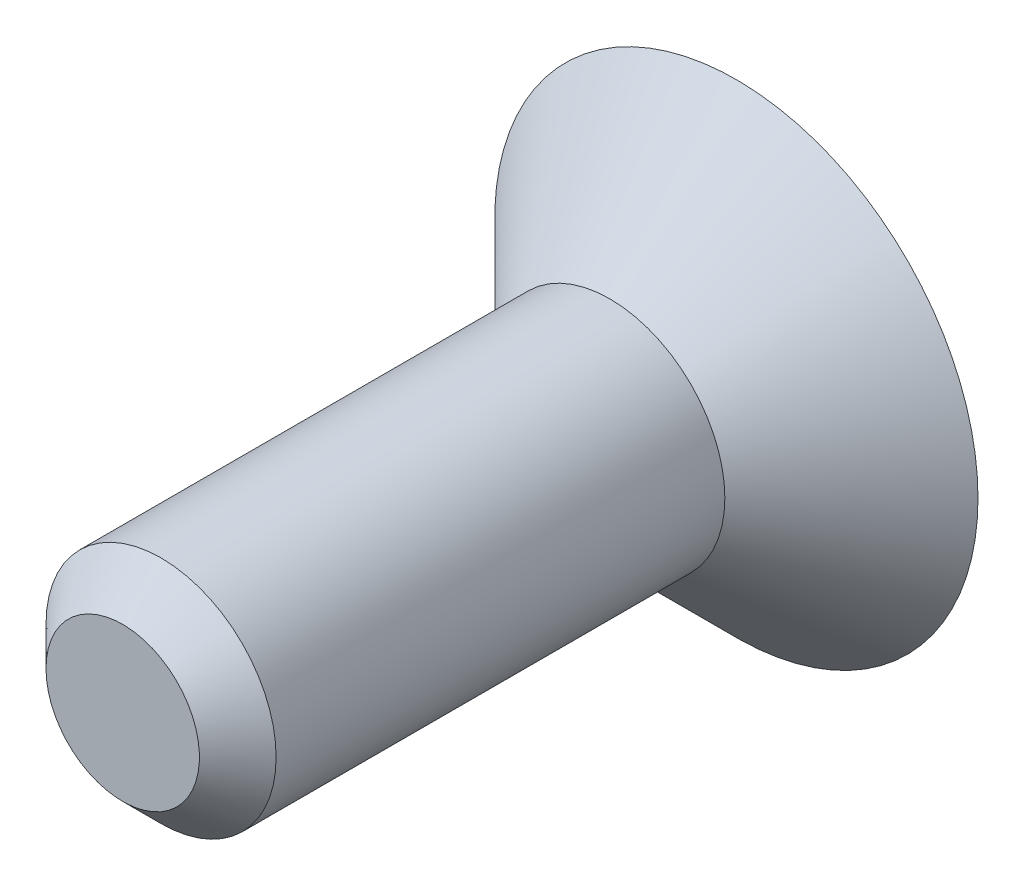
ISO-10303-21;
HEADER;
FILE_DESCRIPTION(('STEP AP214'),'2;1');
FILE_NAME('part.step','',(''),(''),'','','');
FILE_SCHEMA(('AUTOMOTIVE_DESIGN { 1 0 10303 214 1 1 1 1 }'));
ENDSEC;
DATA;
#1=APPLICATION_CONTEXT('core data for automotive mechanical design processes');
#2=APPLICATION_PROTOCOL_DEFINITION('international standard','automotive_design',2000,#1);
#3=PRODUCT_CONTEXT('',#1,'mechanical');
#4=PRODUCT('Part','Part','',(#3));
#5=PRODUCT_RELATED_PRODUCT_CATEGORY('part','',(#4));
#6=PRODUCT_DEFINITION_FORMATION('','',#4);
#7=PRODUCT_DEFINITION_CONTEXT('part definition',#1,'design');
#8=PRODUCT_DEFINITION('design','',#6,#7);
#9=PRODUCT_DEFINITION_SHAPE('','',#8);
#10=(LENGTH_UNIT() NAMED_UNIT(*) SI_UNIT(.MILLI.,.METRE.));
#11=(NAMED_UNIT(*) PLANE_ANGLE_UNIT() SI_UNIT($,.RADIAN.));
#12=(NAMED_UNIT(*) SI_UNIT($,.STERADIAN.) SOLID_ANGLE_UNIT());
#13=UNCERTAINTY_MEASURE_WITH_UNIT(LENGTH_MEASURE(1.E-05),#10,'distance_accuracy_value','');
#14=(GEOMETRIC_REPRESENTATION_CONTEXT(3) GLOBAL_UNCERTAINTY_ASSIGNED_CONTEXT((#13)) GLOBAL_UNIT_ASSIGNED_CONTEXT((#10,
#11,#12)) REPRESENTATION_CONTEXT('',''));
#15=CARTESIAN_POINT('',(0.,0.,0.));
#16=DIRECTION('',(0.,0.,1.));
#17=DIRECTION('',(1.,0.,0.));
#18=AXIS2_PLACEMENT_3D('',#15,#16,#17);
#19=CARTESIAN_POINT('',(0.,0.,0.));
#20=DIRECTION('',(0.,0.,1.));
#21=DIRECTION('',(1.,0.,0.));
#22=AXIS2_PLACEMENT_3D('',#19,#20,#21);
#23=PLANE('',#22);
#24=CARTESIAN_POINT('',(0.,0.,0.));
#25=DIRECTION('',(0.,0.,1.));
#26=DIRECTION('',(1.,0.,0.));
#27=AXIS2_PLACEMENT_3D('',#24,#25,#26);
#28=CIRCLE('',#27,3.15);
#29=CARTESIAN_POINT('',(3.15,0.,0.));
#30=VERTEX_POINT('',#29);
#31=EDGE_CURVE('E214',#30,#30,#28,.T.);
#32=ORIENTED_EDGE('',*,*,#31,.F.);
#33=EDGE_LOOP('',(#32));
#34=FACE_BOUND('',#33,.T.);
#35=DIRECTION('',(0.,-1.,0.));
#36=VECTOR('',#35,1.);
#37=CARTESIAN_POINT('',(-0.399999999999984,1.57500000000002,0.));
#38=LINE('',#37,#36);
#39=CARTESIAN_POINT('',(-0.399999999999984,1.57500000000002,0.));
#40=VERTEX_POINT('',#39);
#41=CARTESIAN_POINT('',(-0.39999999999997,0.400000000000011,0.));
#42=VERTEX_POINT('',#41);
#43=EDGE_CURVE('E120',#40,#42,#38,.T.);
#44=ORIENTED_EDGE('',*,*,#43,.T.);
#45=DIRECTION('',(-1.,0.,0.));
#46=VECTOR('',#45,1.);
#47=CARTESIAN_POINT('',(-1.57499999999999,0.400000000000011,0.));
#48=LINE('',#47,#46);
#49=CARTESIAN_POINT('',(-1.57499999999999,0.400000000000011,0.));
#50=VERTEX_POINT('',#49);
#51=EDGE_CURVE('E184',#42,#50,#48,.T.);
#52=ORIENTED_EDGE('',*,*,#51,.T.);
#53=DIRECTION('',(0.,-1.,0.));
#54=VECTOR('',#53,1.);
#55=CARTESIAN_POINT('',(-1.57499999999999,0.400000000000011,0.));
#56=LINE('',#55,#54);
#57=CARTESIAN_POINT('',(-1.57500000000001,-0.400000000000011,0.));
#58=VERTEX_POINT('',#57);
#59=EDGE_CURVE('E174',#50,#58,#56,.T.);
#60=ORIENTED_EDGE('',*,*,#59,.T.);
#61=DIRECTION('',(1.,0.,0.));
#62=VECTOR('',#61,1.);
#63=CARTESIAN_POINT('',(-1.57500000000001,-0.400000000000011,0.));
#64=LINE('',#63,#62);
#65=CARTESIAN_POINT('',(-0.399999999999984,-0.400000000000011,0.));
#66=VERTEX_POINT('',#65);
#67=EDGE_CURVE('E178',#58,#66,#64,.T.);
#68=ORIENTED_EDGE('',*,*,#67,.T.);
#69=CARTESIAN_POINT('',(-0.399999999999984,-1.57499999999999,0.));
#70=VERTEX_POINT('',#69);
#71=EDGE_CURVE('E130',#66,#70,#38,.T.);
#72=ORIENTED_EDGE('',*,*,#71,.T.);
#73=DIRECTION('',(1.,0.,0.));
#74=VECTOR('',#73,1.);
#75=CARTESIAN_POINT('',(0.399999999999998,-1.57499999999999,0.));
#76=LINE('',#75,#74);
#77=CARTESIAN_POINT('',(0.399999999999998,-1.57499999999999,0.));
#78=VERTEX_POINT('',#77);
#79=EDGE_CURVE('E129',#70,#78,#76,.T.);
#80=ORIENTED_EDGE('',*,*,#79,.T.);
#81=DIRECTION('',(0.,1.,0.));
#82=VECTOR('',#81,1.);
#83=CARTESIAN_POINT('',(0.400000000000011,1.57500000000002,0.));
#84=LINE('',#83,#82);
#85=CARTESIAN_POINT('',(0.399999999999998,-0.400000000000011,0.));
#86=VERTEX_POINT('',#85);
#87=EDGE_CURVE('E150',#78,#86,#84,.T.);
#88=ORIENTED_EDGE('',*,*,#87,.T.);
#89=CARTESIAN_POINT('',(1.57500000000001,-0.400000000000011,0.));
#90=VERTEX_POINT('',#89);
#91=EDGE_CURVE('E177',#86,#90,#64,.T.);
#92=ORIENTED_EDGE('',*,*,#91,.T.);
#93=DIRECTION('',(0.,1.,0.));
#94=VECTOR('',#93,1.);
#95=CARTESIAN_POINT('',(1.57500000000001,0.400000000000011,0.));
#96=LINE('',#95,#94);
#97=CARTESIAN_POINT('',(1.57500000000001,0.400000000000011,0.));
#98=VERTEX_POINT('',#97);
#99=EDGE_CURVE('E181',#90,#98,#96,.T.);
#100=ORIENTED_EDGE('',*,*,#99,.T.);
#101=CARTESIAN_POINT('',(0.400000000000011,0.400000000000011,0.));
#102=VERTEX_POINT('',#101);
#103=EDGE_CURVE('E185',#98,#102,#48,.T.);
#104=ORIENTED_EDGE('',*,*,#103,.T.);
#105=CARTESIAN_POINT('',(0.400000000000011,1.57500000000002,0.));
#106=VERTEX_POINT('',#105);
#107=EDGE_CURVE('E144',#102,#106,#84,.T.);
#108=ORIENTED_EDGE('',*,*,#107,.T.);
#109=DIRECTION('',(-1.,0.,0.));
#110=VECTOR('',#109,1.);
#111=CARTESIAN_POINT('',(0.400000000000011,1.57500000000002,0.));
#112=LINE('',#111,#110);
#113=EDGE_CURVE('E137',#106,#40,#112,.T.);
#114=ORIENTED_EDGE('',*,*,#113,.T.);
#115=EDGE_LOOP('',(#44,#52,#60,#68,#72,#80,#88,#92,#100,#104,#108,#114));
#116=FACE_BOUND('',#115,.T.);
#117=ADVANCED_FACE('F31',(#34,#116),#23,.F.);
#118=CARTESIAN_POINT('',(-1.57500000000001,-0.400000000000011,0.8));
#119=DIRECTION('',(0.,1.,0.));
#120=DIRECTION('',(0.,0.,1.));
#121=AXIS2_PLACEMENT_3D('',#118,#119,#120);
#122=PLANE('',#121);
#123=DIRECTION('',(1.,0.,0.));
#124=VECTOR('',#123,1.);
#125=CARTESIAN_POINT('',(-1.57500000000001,-0.400000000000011,0.8));
#126=LINE('',#125,#124);
#127=CARTESIAN_POINT('',(-1.57500000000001,-0.400000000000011,0.8));
#128=VERTEX_POINT('',#127);
#129=CARTESIAN_POINT('',(-0.399999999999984,-0.400000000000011,0.8));
#130=VERTEX_POINT('',#129);
#131=EDGE_CURVE('E191',#128,#130,#126,.T.);
#132=ORIENTED_EDGE('',*,*,#131,.T.);
#133=DIRECTION('',(0.,0.,-1.));
#134=VECTOR('',#133,1.);
#135=CARTESIAN_POINT('',(-0.399999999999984,-0.400000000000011,0.8));
#136=LINE('',#135,#134);
#137=EDGE_CURVE('E171',#130,#66,#136,.T.);
#138=ORIENTED_EDGE('',*,*,#137,.T.);
#139=ORIENTED_EDGE('',*,*,#67,.F.);
#140=DIRECTION('',(0.,0.,-1.));
#141=VECTOR('',#140,1.);
#142=CARTESIAN_POINT('',(-1.57500000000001,-0.400000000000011,0.8));
#143=LINE('',#142,#141);
#144=EDGE_CURVE('E208',#128,#58,#143,.T.);
#145=ORIENTED_EDGE('',*,*,#144,.F.);
#146=EDGE_LOOP('',(#132,#138,#139,#145));
#147=FACE_BOUND('',#146,.T.);
#148=ADVANCED_FACE('F236',(#147),#122,.T.);
#149=ORIENTED_EDGE('',*,*,#91,.F.);
#150=DIRECTION('',(0.,0.,1.));
#151=VECTOR('',#150,1.);
#152=CARTESIAN_POINT('',(0.399999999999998,-0.400000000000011,0.8));
#153=LINE('',#152,#151);
#154=CARTESIAN_POINT('',(0.399999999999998,-0.400000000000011,0.8));
#155=VERTEX_POINT('',#154);
#156=EDGE_CURVE('E167',#86,#155,#153,.T.);
#157=ORIENTED_EDGE('',*,*,#156,.T.);
#158=CARTESIAN_POINT('',(1.57500000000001,-0.400000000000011,0.8));
#159=VERTEX_POINT('',#158);
#160=EDGE_CURVE('E190',#155,#159,#126,.T.);
#161=ORIENTED_EDGE('',*,*,#160,.T.);
#162=DIRECTION('',(0.,0.,-1.));
#163=VECTOR('',#162,1.);
#164=CARTESIAN_POINT('',(1.57500000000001,-0.400000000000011,0.8));
#165=LINE('',#164,#163);
#166=EDGE_CURVE('E205',#159,#90,#165,.T.);
#167=ORIENTED_EDGE('',*,*,#166,.T.);
#168=EDGE_LOOP('',(#149,#157,#161,#167));
#169=FACE_BOUND('',#168,.T.);
#170=ADVANCED_FACE('F241',(#169),#122,.T.);
#171=CARTESIAN_POINT('',(-1.57499999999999,0.400000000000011,0.8));
#172=DIRECTION('',(0.,-1.,0.));
#173=DIRECTION('',(0.,0.,-1.));
#174=AXIS2_PLACEMENT_3D('',#171,#172,#173);
#175=PLANE('',#174);
#176=ORIENTED_EDGE('',*,*,#51,.F.);
#177=DIRECTION('',(0.,0.,1.));
#178=VECTOR('',#177,1.);
#179=CARTESIAN_POINT('',(-0.39999999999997,0.400000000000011,0.8));
#180=LINE('',#179,#178);
#181=CARTESIAN_POINT('',(-0.39999999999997,0.400000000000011,0.8));
#182=VERTEX_POINT('',#181);
#183=EDGE_CURVE('E125',#42,#182,#180,.T.);
#184=ORIENTED_EDGE('',*,*,#183,.T.);
#185=DIRECTION('',(-1.,0.,0.));
#186=VECTOR('',#185,1.);
#187=CARTESIAN_POINT('',(-1.57499999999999,0.400000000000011,0.8));
#188=LINE('',#187,#186);
#189=CARTESIAN_POINT('',(-1.57499999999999,0.400000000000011,0.8));
#190=VERTEX_POINT('',#189);
#191=EDGE_CURVE('E196',#182,#190,#188,.T.);
#192=ORIENTED_EDGE('',*,*,#191,.T.);
#193=DIRECTION('',(0.,0.,-1.));
#194=VECTOR('',#193,1.);
#195=CARTESIAN_POINT('',(-1.57499999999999,0.400000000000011,0.8));
#196=LINE('',#195,#194);
#197=EDGE_CURVE('E200',#190,#50,#196,.T.);
#198=ORIENTED_EDGE('',*,*,#197,.T.);
#199=EDGE_LOOP('',(#176,#184,#192,#198));
#200=FACE_BOUND('',#199,.T.);
#201=ADVANCED_FACE('F261',(#200),#175,.T.);
#202=CARTESIAN_POINT('',(1.57500000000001,0.400000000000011,0.8));
#203=VERTEX_POINT('',#202);
#204=CARTESIAN_POINT('',(0.400000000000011,0.400000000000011,0.8));
#205=VERTEX_POINT('',#204);
#206=EDGE_CURVE('E197',#203,#205,#188,.T.);
#207=ORIENTED_EDGE('',*,*,#206,.T.);
#208=DIRECTION('',(0.,0.,-1.));
#209=VECTOR('',#208,1.);
#210=CARTESIAN_POINT('',(0.400000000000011,0.400000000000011,0.8));
#211=LINE('',#210,#209);
#212=EDGE_CURVE('E140',#205,#102,#211,.T.);
#213=ORIENTED_EDGE('',*,*,#212,.T.);
#214=ORIENTED_EDGE('',*,*,#103,.F.);
#215=DIRECTION('',(0.,0.,-1.));
#216=VECTOR('',#215,1.);
#217=CARTESIAN_POINT('',(1.57500000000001,0.400000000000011,0.8));
#218=LINE('',#217,#216);
#219=EDGE_CURVE('E203',#203,#98,#218,.T.);
#220=ORIENTED_EDGE('',*,*,#219,.F.);
#221=EDGE_LOOP('',(#207,#213,#214,#220));
#222=FACE_BOUND('',#221,.T.);
#223=ADVANCED_FACE('F264',(#222),#175,.T.);
#224=CARTESIAN_POINT('',(0.,0.,0.));
#225=DIRECTION('',(0.,0.,-1.));
#226=DIRECTION('',(1.,0.,0.));
#227=AXIS2_PLACEMENT_3D('',#224,#225,#226);
#228=CONICAL_SURFACE('',#227,3.15,0.78539816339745);
#229=CARTESIAN_POINT('',(0.,0.,1.64999999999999));
#230=DIRECTION('',(0.,0.,-1.));
#231=DIRECTION('',(-1.,0.,0.));
#232=AXIS2_PLACEMENT_3D('',#229,#230,#231);
#233=CIRCLE('',#232,1.5);
#234=CARTESIAN_POINT('',(-1.5,0.,1.64999999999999));
#235=VERTEX_POINT('',#234);
#236=EDGE_CURVE('E211',#235,#235,#233,.T.);
#237=ORIENTED_EDGE('',*,*,#236,.T.);
#238=EDGE_LOOP('',(#237));
#239=FACE_BOUND('',#238,.T.);
#240=ORIENTED_EDGE('',*,*,#31,.T.);
#241=EDGE_LOOP('',(#240));
#242=FACE_BOUND('',#241,.T.);
#243=ADVANCED_FACE('F33',(#239,#242),#228,.T.);
#244=CARTESIAN_POINT('',(0.,0.,7.99999999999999));
#245=DIRECTION('',(0.,0.,-1.));
#246=DIRECTION('',(-1.,0.,0.));
#247=AXIS2_PLACEMENT_3D('',#244,#245,#246);
#248=CYLINDRICAL_SURFACE('',#247,1.5);
#249=CARTESIAN_POINT('',(0.,0.,7.49999999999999));
#250=DIRECTION('',(0.,0.,-1.));
#251=DIRECTION('',(-1.,0.,0.));
#252=AXIS2_PLACEMENT_3D('',#249,#250,#251);
#253=CIRCLE('',#252,1.5);
#254=CARTESIAN_POINT('',(-1.5,0.,7.49999999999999));
#255=VERTEX_POINT('',#254);
#256=EDGE_CURVE('E39',#255,#255,#253,.T.);
#257=ORIENTED_EDGE('',*,*,#256,.T.);
#258=EDGE_LOOP('',(#257));
#259=FACE_BOUND('',#258,.T.);
#260=ORIENTED_EDGE('',*,*,#236,.F.);
#261=EDGE_LOOP('',(#260));
#262=FACE_BOUND('',#261,.T.);
#263=ADVANCED_FACE('F219',(#259,#262),#248,.T.);
#264=CARTESIAN_POINT('',(0.,0.,7.99999999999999));
#265=DIRECTION('',(0.,0.,-1.));
#266=DIRECTION('',(-1.,0.,0.));
#267=AXIS2_PLACEMENT_3D('',#264,#265,#266);
#268=PLANE('',#267);
#269=CARTESIAN_POINT('',(0.,0.,7.99999999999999));
#270=DIRECTION('',(0.,0.,-1.));
#271=DIRECTION('',(-1.,0.,0.));
#272=AXIS2_PLACEMENT_3D('',#269,#270,#271);
#273=CIRCLE('',#272,0.999999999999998);
#274=CARTESIAN_POINT('',(-0.999999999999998,0.,7.99999999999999));
#275=VERTEX_POINT('',#274);
#276=EDGE_CURVE('E11',#275,#275,#273,.F.);
#277=ORIENTED_EDGE('',*,*,#276,.T.);
#278=EDGE_LOOP('',(#277));
#279=FACE_BOUND('',#278,.T.);
#280=ADVANCED_FACE('F248',(#279),#268,.F.);
#281=CARTESIAN_POINT('',(-1.57499999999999,0.400000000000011,0.8));
#282=DIRECTION('',(1.,0.,0.));
#283=DIRECTION('',(0.,0.,-1.));
#284=AXIS2_PLACEMENT_3D('',#281,#282,#283);
#285=PLANE('',#284);
#286=ORIENTED_EDGE('',*,*,#59,.F.);
#287=ORIENTED_EDGE('',*,*,#197,.F.);
#288=DIRECTION('',(0.,-1.,0.));
#289=VECTOR('',#288,1.);
#290=CARTESIAN_POINT('',(-1.57499999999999,0.400000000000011,0.8));
#291=LINE('',#290,#289);
#292=EDGE_CURVE('E187',#190,#128,#291,.T.);
#293=ORIENTED_EDGE('',*,*,#292,.T.);
#294=ORIENTED_EDGE('',*,*,#144,.T.);
#295=EDGE_LOOP('',(#286,#287,#293,#294));
#296=FACE_BOUND('',#295,.T.);
#297=ADVANCED_FACE('F251',(#296),#285,.T.);
#298=CARTESIAN_POINT('',(1.57500000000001,0.400000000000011,0.8));
#299=DIRECTION('',(-1.,0.,0.));
#300=DIRECTION('',(0.,0.,1.));
#301=AXIS2_PLACEMENT_3D('',#298,#299,#300);
#302=PLANE('',#301);
#303=ORIENTED_EDGE('',*,*,#99,.F.);
#304=ORIENTED_EDGE('',*,*,#166,.F.);
#305=DIRECTION('',(0.,1.,0.));
#306=VECTOR('',#305,1.);
#307=CARTESIAN_POINT('',(1.57500000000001,0.400000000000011,0.8));
#308=LINE('',#307,#306);
#309=EDGE_CURVE('E194',#159,#203,#308,.T.);
#310=ORIENTED_EDGE('',*,*,#309,.T.);
#311=ORIENTED_EDGE('',*,*,#219,.T.);
#312=EDGE_LOOP('',(#303,#304,#310,#311));
#313=FACE_BOUND('',#312,.T.);
#314=ADVANCED_FACE('F254',(#313),#302,.T.);
#315=CARTESIAN_POINT('',(-1.57500000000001,-0.400000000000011,0.8));
#316=DIRECTION('',(0.,0.,1.));
#317=DIRECTION('',(1.,0.,0.));
#318=AXIS2_PLACEMENT_3D('',#315,#316,#317);
#319=PLANE('',#318);
#320=ORIENTED_EDGE('',*,*,#160,.F.);
#321=DIRECTION('',(0.,1.,0.));
#322=VECTOR('',#321,1.);
#323=CARTESIAN_POINT('',(0.400000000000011,1.57500000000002,0.8));
#324=LINE('',#323,#322);
#325=CARTESIAN_POINT('',(0.399999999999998,-1.57499999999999,0.8));
#326=VERTEX_POINT('',#325);
#327=EDGE_CURVE('E158',#326,#155,#324,.T.);
#328=ORIENTED_EDGE('',*,*,#327,.F.);
#329=DIRECTION('',(1.,0.,0.));
#330=VECTOR('',#329,1.);
#331=CARTESIAN_POINT('',(0.399999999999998,-1.57499999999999,0.8));
#332=LINE('',#331,#330);
#333=CARTESIAN_POINT('',(-0.399999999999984,-1.57499999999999,0.8));
#334=VERTEX_POINT('',#333);
#335=EDGE_CURVE('E156',#334,#326,#332,.T.);
#336=ORIENTED_EDGE('',*,*,#335,.F.);
#337=DIRECTION('',(0.,-1.,0.));
#338=VECTOR('',#337,1.);
#339=CARTESIAN_POINT('',(-0.399999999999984,1.57500000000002,0.8));
#340=LINE('',#339,#338);
#341=EDGE_CURVE('E46',#130,#334,#340,.T.);
#342=ORIENTED_EDGE('',*,*,#341,.F.);
#343=ORIENTED_EDGE('',*,*,#131,.F.);
#344=ORIENTED_EDGE('',*,*,#292,.F.);
#345=ORIENTED_EDGE('',*,*,#191,.F.);
#346=CARTESIAN_POINT('',(-0.399999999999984,1.57500000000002,0.8));
#347=VERTEX_POINT('',#346);
#348=EDGE_CURVE('E154',#347,#182,#340,.T.);
#349=ORIENTED_EDGE('',*,*,#348,.F.);
#350=DIRECTION('',(-1.,0.,0.));
#351=VECTOR('',#350,1.);
#352=CARTESIAN_POINT('',(0.400000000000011,1.57500000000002,0.8));
#353=LINE('',#352,#351);
#354=CARTESIAN_POINT('',(0.400000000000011,1.57500000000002,0.8));
#355=VERTEX_POINT('',#354);
#356=EDGE_CURVE('E139',#355,#347,#353,.T.);
#357=ORIENTED_EDGE('',*,*,#356,.F.);
#358=EDGE_CURVE('E53',#205,#355,#324,.T.);
#359=ORIENTED_EDGE('',*,*,#358,.F.);
#360=ORIENTED_EDGE('',*,*,#206,.F.);
#361=ORIENTED_EDGE('',*,*,#309,.F.);
#362=EDGE_LOOP('',(#320,#328,#336,#342,#343,#344,#345,#349,#357,#359,#360,#361));
#363=FACE_BOUND('',#362,.T.);
#364=ADVANCED_FACE('F259',(#363),#319,.F.);
#365=CARTESIAN_POINT('',(0.400000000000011,1.57500000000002,0.8));
#366=DIRECTION('',(-1.,0.,0.));
#367=DIRECTION('',(0.,-1.,0.));
#368=AXIS2_PLACEMENT_3D('',#365,#366,#367);
#369=PLANE('',#368);
#370=ORIENTED_EDGE('',*,*,#358,.T.);
#371=DIRECTION('',(0.,0.,-1.));
#372=VECTOR('',#371,1.);
#373=CARTESIAN_POINT('',(0.400000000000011,1.57500000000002,0.8));
#374=LINE('',#373,#372);
#375=EDGE_CURVE('E160',#355,#106,#374,.T.);
#376=ORIENTED_EDGE('',*,*,#375,.T.);
#377=ORIENTED_EDGE('',*,*,#107,.F.);
#378=ORIENTED_EDGE('',*,*,#212,.F.);
#379=EDGE_LOOP('',(#370,#376,#377,#378));
#380=FACE_BOUND('',#379,.T.);
#381=ADVANCED_FACE('F268',(#380),#369,.T.);
#382=CARTESIAN_POINT('',(-0.399999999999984,1.57500000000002,0.8));
#383=DIRECTION('',(1.,0.,0.));
#384=DIRECTION('',(0.,1.,0.));
#385=AXIS2_PLACEMENT_3D('',#382,#383,#384);
#386=PLANE('',#385);
#387=ORIENTED_EDGE('',*,*,#43,.F.);
#388=DIRECTION('',(0.,0.,-1.));
#389=VECTOR('',#388,1.);
#390=CARTESIAN_POINT('',(-0.399999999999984,1.57500000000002,0.8));
#391=LINE('',#390,#389);
#392=EDGE_CURVE('E123',#347,#40,#391,.T.);
#393=ORIENTED_EDGE('',*,*,#392,.F.);
#394=ORIENTED_EDGE('',*,*,#348,.T.);
#395=ORIENTED_EDGE('',*,*,#183,.F.);
#396=EDGE_LOOP('',(#387,#393,#394,#395));
#397=FACE_BOUND('',#396,.T.);
#398=ADVANCED_FACE('F122',(#397),#386,.T.);
#399=CARTESIAN_POINT('',(0.400000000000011,1.57500000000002,0.8));
#400=DIRECTION('',(0.,-1.,0.));
#401=DIRECTION('',(1.,0.,0.));
#402=AXIS2_PLACEMENT_3D('',#399,#400,#401);
#403=PLANE('',#402);
#404=ORIENTED_EDGE('',*,*,#113,.F.);
#405=ORIENTED_EDGE('',*,*,#375,.F.);
#406=ORIENTED_EDGE('',*,*,#356,.T.);
#407=ORIENTED_EDGE('',*,*,#392,.T.);
#408=EDGE_LOOP('',(#404,#405,#406,#407));
#409=FACE_BOUND('',#408,.T.);
#410=ADVANCED_FACE('F135',(#409),#403,.T.);
#411=ORIENTED_EDGE('',*,*,#341,.T.);
#412=DIRECTION('',(0.,0.,-1.));
#413=VECTOR('',#412,1.);
#414=CARTESIAN_POINT('',(-0.399999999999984,-1.57499999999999,0.8));
#415=LINE('',#414,#413);
#416=EDGE_CURVE('E141',#334,#70,#415,.T.);
#417=ORIENTED_EDGE('',*,*,#416,.T.);
#418=ORIENTED_EDGE('',*,*,#71,.F.);
#419=ORIENTED_EDGE('',*,*,#137,.F.);
#420=EDGE_LOOP('',(#411,#417,#418,#419));
#421=FACE_BOUND('',#420,.T.);
#422=ADVANCED_FACE('F271',(#421),#386,.T.);
#423=ORIENTED_EDGE('',*,*,#87,.F.);
#424=DIRECTION('',(0.,0.,-1.));
#425=VECTOR('',#424,1.);
#426=CARTESIAN_POINT('',(0.399999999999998,-1.57499999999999,0.8));
#427=LINE('',#426,#425);
#428=EDGE_CURVE('E162',#326,#78,#427,.T.);
#429=ORIENTED_EDGE('',*,*,#428,.F.);
#430=ORIENTED_EDGE('',*,*,#327,.T.);
#431=ORIENTED_EDGE('',*,*,#156,.F.);
#432=EDGE_LOOP('',(#423,#429,#430,#431));
#433=FACE_BOUND('',#432,.T.);
#434=ADVANCED_FACE('F230',(#433),#369,.T.);
#435=CARTESIAN_POINT('',(0.399999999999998,-1.57499999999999,0.8));
#436=DIRECTION('',(0.,1.,0.));
#437=DIRECTION('',(-1.,0.,0.));
#438=AXIS2_PLACEMENT_3D('',#435,#436,#437);
#439=PLANE('',#438);
#440=ORIENTED_EDGE('',*,*,#79,.F.);
#441=ORIENTED_EDGE('',*,*,#416,.F.);
#442=ORIENTED_EDGE('',*,*,#335,.T.);
#443=ORIENTED_EDGE('',*,*,#428,.T.);
#444=EDGE_LOOP('',(#440,#441,#442,#443));
#445=FACE_BOUND('',#444,.T.);
#446=ADVANCED_FACE('F224',(#445),#439,.T.);
#447=CARTESIAN_POINT('',(0.,0.,7.49999999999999));
#448=DIRECTION('',(0.,0.,-1.));
#449=DIRECTION('',(-1.,0.,0.));
#450=AXIS2_PLACEMENT_3D('',#447,#448,#449);
#451=CONICAL_SURFACE('',#450,1.5,0.785398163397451);
#452=ORIENTED_EDGE('',*,*,#276,.F.);
#453=EDGE_LOOP('',(#452));
#454=FACE_BOUND('',#453,.T.);
#455=ORIENTED_EDGE('',*,*,#256,.F.);
#456=EDGE_LOOP('',(#455));
#457=FACE_BOUND('',#456,.T.);
#458=ADVANCED_FACE('F222',(#454,#457),#451,.T.);
#459=CLOSED_SHELL('',(#117,#148,#170,#201,#223,#243,#263,#280,#297,#314,#364,#381,#398,#410,
#422,#434,#446,#458));
#460=MANIFOLD_SOLID_BREP('B2',#459);
#461=ADVANCED_BREP_SHAPE_REPRESENTATION('',(#18,#460),#14);
#462=SHAPE_DEFINITION_REPRESENTATION(#9,#461);
ENDSEC;
END-ISO-10303-21;
